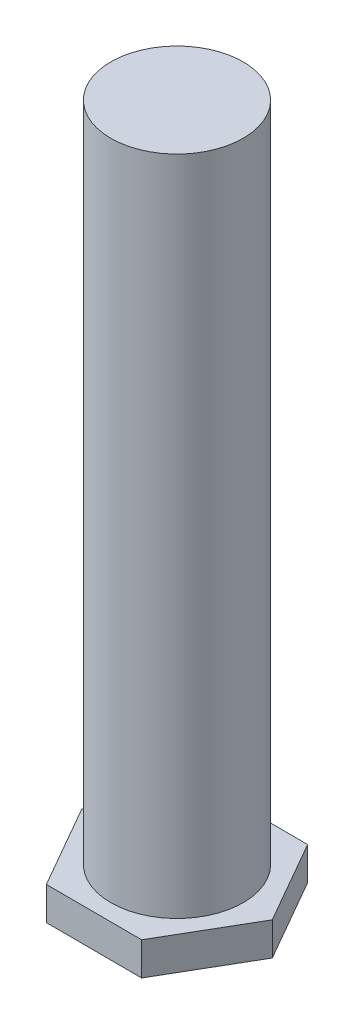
from build123d import *

# Parameters (mm, degrees)
BOSS_EXTRUDE1_DEPTH = 2
SKETCH2_R           = 4
BOSS_EXTRUDE2_DEPTH = 40


with BuildPart() as part:
    # Sketch1 → Boss-Extrude1 (new body)
    with BuildSketch(Plane(origin=(0, 0, 0), x_dir=(1, 0, 0), z_dir=(0, 1, 0))):
        Polygon((2.87132836, -5.008872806), (5.773475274, -0.017793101), (2.902146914, 4.991079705), (-2.87132836, 5.008872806), (-5.773475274, 0.017793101), (-2.902146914, -4.991079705), align=None)
    extrude(amount=BOSS_EXTRUDE1_DEPTH)

    # Sketch2 → Boss-Extrude2 (add)
    with BuildSketch(Plane(origin=(0, 2, 0), x_dir=(1, 0, 0), z_dir=(0, 1, 0))):
        with Locations(Location((0, 0, 0), (0, 0, 270))):
            Circle(SKETCH2_R)
    extrude(amount=BOSS_EXTRUDE2_DEPTH)


solid = part.part
